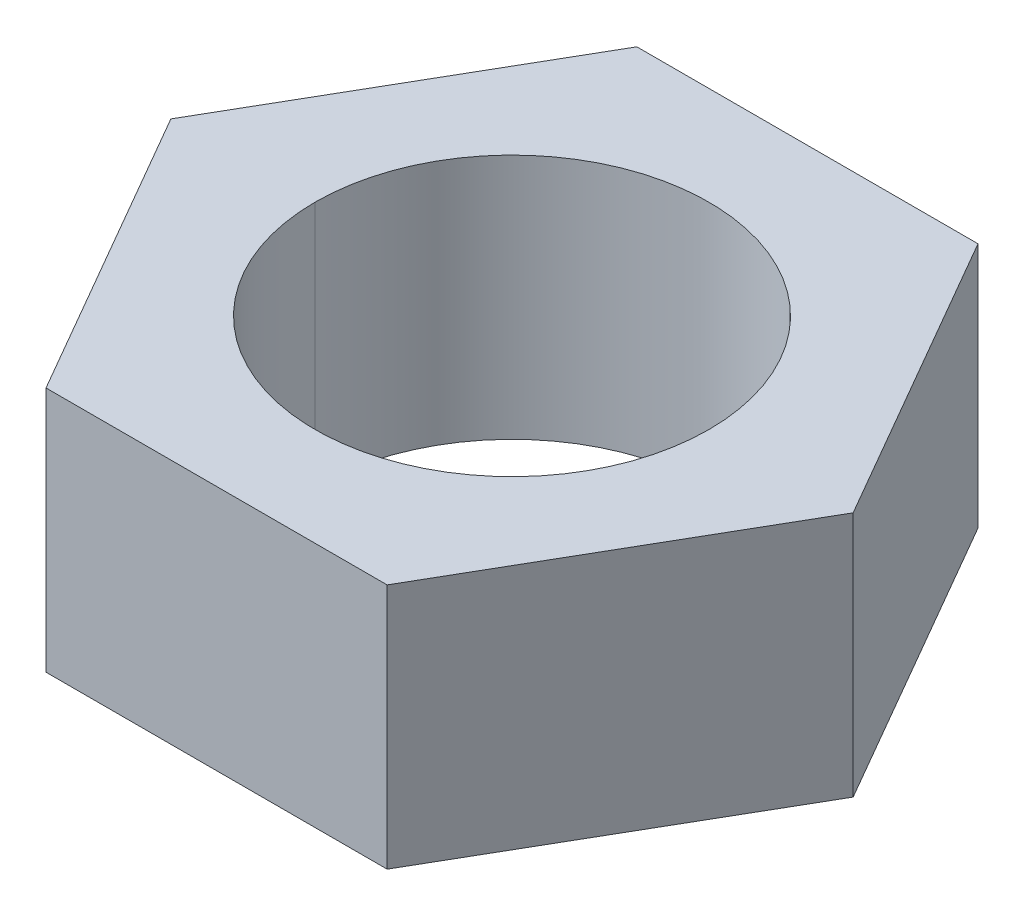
ISO-10303-21;
HEADER;
FILE_DESCRIPTION(('STEP AP214'),'2;1');
FILE_NAME('part.step','',(''),(''),'','','');
FILE_SCHEMA(('AUTOMOTIVE_DESIGN { 1 0 10303 214 1 1 1 1 }'));
ENDSEC;
DATA;
#1=APPLICATION_CONTEXT('core data for automotive mechanical design processes');
#2=APPLICATION_PROTOCOL_DEFINITION('international standard','automotive_design',2000,#1);
#3=PRODUCT_CONTEXT('',#1,'mechanical');
#4=PRODUCT('Part','Part','',(#3));
#5=PRODUCT_RELATED_PRODUCT_CATEGORY('part','',(#4));
#6=PRODUCT_DEFINITION_FORMATION('','',#4);
#7=PRODUCT_DEFINITION_CONTEXT('part definition',#1,'design');
#8=PRODUCT_DEFINITION('design','',#6,#7);
#9=PRODUCT_DEFINITION_SHAPE('','',#8);
#10=(LENGTH_UNIT() NAMED_UNIT(*) SI_UNIT(.MILLI.,.METRE.));
#11=(NAMED_UNIT(*) PLANE_ANGLE_UNIT() SI_UNIT($,.RADIAN.));
#12=(NAMED_UNIT(*) SI_UNIT($,.STERADIAN.) SOLID_ANGLE_UNIT());
#13=UNCERTAINTY_MEASURE_WITH_UNIT(LENGTH_MEASURE(1.E-05),#10,'distance_accuracy_value','');
#14=(GEOMETRIC_REPRESENTATION_CONTEXT(3) GLOBAL_UNCERTAINTY_ASSIGNED_CONTEXT((#13)) GLOBAL_UNIT_ASSIGNED_CONTEXT((#10,
#11,#12)) REPRESENTATION_CONTEXT('',''));
#15=CARTESIAN_POINT('',(0.,0.,0.));
#16=DIRECTION('',(0.,0.,1.));
#17=DIRECTION('',(1.,0.,0.));
#18=AXIS2_PLACEMENT_3D('',#15,#16,#17);
#19=CARTESIAN_POINT('',(-5.49926131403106,3.96875000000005,9.525));
#20=DIRECTION('',(0.,-1.,0.));
#21=DIRECTION('',(0.,0.,-1.));
#22=AXIS2_PLACEMENT_3D('',#19,#20,#21);
#23=PLANE('',#22);
#24=DIRECTION('',(0.500000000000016,0.,-0.866025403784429));
#25=VECTOR('',#24,1.);
#26=CARTESIAN_POINT('',(5.49926131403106,3.96875000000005,9.525));
#27=LINE('',#26,#25);
#28=CARTESIAN_POINT('',(10.9985226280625,3.96875000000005,0.));
#29=VERTEX_POINT('',#28);
#30=CARTESIAN_POINT('',(5.49926131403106,3.96875000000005,9.525));
#31=VERTEX_POINT('',#30);
#32=EDGE_CURVE('E122',#29,#31,#27,.F.);
#33=ORIENTED_EDGE('',*,*,#32,.F.);
#34=DIRECTION('',(-0.500000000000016,0.,-0.866025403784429));
#35=VECTOR('',#34,1.);
#36=CARTESIAN_POINT('',(10.9985226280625,3.96875000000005,0.));
#37=LINE('',#36,#35);
#38=CARTESIAN_POINT('',(5.49926131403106,3.96875000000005,-9.525));
#39=VERTEX_POINT('',#38);
#40=EDGE_CURVE('E116',#39,#29,#37,.F.);
#41=ORIENTED_EDGE('',*,*,#40,.F.);
#42=DIRECTION('',(-1.,0.,0.));
#43=VECTOR('',#42,1.);
#44=CARTESIAN_POINT('',(5.49926131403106,3.96875000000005,-9.525));
#45=LINE('',#44,#43);
#46=CARTESIAN_POINT('',(-5.49926131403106,3.96875000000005,-9.525));
#47=VERTEX_POINT('',#46);
#48=EDGE_CURVE('E110',#47,#39,#45,.F.);
#49=ORIENTED_EDGE('',*,*,#48,.F.);
#50=DIRECTION('',(-0.500000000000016,0.,0.866025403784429));
#51=VECTOR('',#50,1.);
#52=CARTESIAN_POINT('',(-5.49926131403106,3.96875000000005,-9.525));
#53=LINE('',#52,#51);
#54=CARTESIAN_POINT('',(-10.9985226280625,3.96875000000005,0.));
#55=VERTEX_POINT('',#54);
#56=EDGE_CURVE('E104',#55,#47,#53,.F.);
#57=ORIENTED_EDGE('',*,*,#56,.F.);
#58=DIRECTION('',(0.500000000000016,0.,0.866025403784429));
#59=VECTOR('',#58,1.);
#60=CARTESIAN_POINT('',(-10.9985226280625,3.96875000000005,0.));
#61=LINE('',#60,#59);
#62=CARTESIAN_POINT('',(-5.49926131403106,3.96875000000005,9.525));
#63=VERTEX_POINT('',#62);
#64=EDGE_CURVE('E95',#63,#55,#61,.F.);
#65=ORIENTED_EDGE('',*,*,#64,.F.);
#66=DIRECTION('',(1.,0.,0.));
#67=VECTOR('',#66,1.);
#68=CARTESIAN_POINT('',(-5.49926131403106,3.96875000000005,9.525));
#69=LINE('',#68,#67);
#70=EDGE_CURVE('E127',#31,#63,#69,.F.);
#71=ORIENTED_EDGE('',*,*,#70,.F.);
#72=EDGE_LOOP('',(#33,#41,#49,#57,#65,#71));
#73=FACE_BOUND('',#72,.T.);
#74=CARTESIAN_POINT('',(0.,3.96875000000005,0.));
#75=DIRECTION('',(0.,-1.,0.));
#76=DIRECTION('',(0.,0.,-1.));
#77=AXIS2_PLACEMENT_3D('',#74,#75,#76);
#78=CIRCLE('',#77,6.35);
#79=CARTESIAN_POINT('',(6.35,3.96875000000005,0.));
#80=VERTEX_POINT('',#79);
#81=CARTESIAN_POINT('',(-6.35,3.96875000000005,0.));
#82=VERTEX_POINT('',#81);
#83=EDGE_CURVE('E19',#80,#82,#78,.T.);
#84=ORIENTED_EDGE('',*,*,#83,.T.);
#85=CARTESIAN_POINT('',(0.,3.96875000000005,0.));
#86=DIRECTION('',(0.,-1.,0.));
#87=DIRECTION('',(0.,0.,-1.));
#88=AXIS2_PLACEMENT_3D('',#85,#86,#87);
#89=CIRCLE('',#88,6.35);
#90=EDGE_CURVE('E79',#82,#80,#89,.T.);
#91=ORIENTED_EDGE('',*,*,#90,.T.);
#92=EDGE_LOOP('',(#84,#91));
#93=FACE_BOUND('',#92,.T.);
#94=ADVANCED_FACE('F16',(#73,#93),#23,.F.);
#95=CARTESIAN_POINT('',(0.,3.96875000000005,0.));
#96=DIRECTION('',(0.,-1.,0.));
#97=DIRECTION('',(0.,0.,-1.));
#98=AXIS2_PLACEMENT_3D('',#95,#96,#97);
#99=CYLINDRICAL_SURFACE('',#98,6.35);
#100=CARTESIAN_POINT('',(0.,-3.96875000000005,0.));
#101=DIRECTION('',(0.,-1.,0.));
#102=DIRECTION('',(0.,0.,-1.));
#103=AXIS2_PLACEMENT_3D('',#100,#101,#102);
#104=CIRCLE('',#103,6.35);
#105=CARTESIAN_POINT('',(-6.35,-3.96875000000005,0.));
#106=VERTEX_POINT('',#105);
#107=CARTESIAN_POINT('',(6.35,-3.96875000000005,0.));
#108=VERTEX_POINT('',#107);
#109=EDGE_CURVE('E88',#106,#108,#104,.F.);
#110=ORIENTED_EDGE('',*,*,#109,.F.);
#111=DIRECTION('',(0.,-1.,0.));
#112=VECTOR('',#111,1.);
#113=CARTESIAN_POINT('',(-6.35,3.96875000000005,0.));
#114=LINE('',#113,#112);
#115=EDGE_CURVE('E84',#106,#82,#114,.F.);
#116=ORIENTED_EDGE('',*,*,#115,.T.);
#117=ORIENTED_EDGE('',*,*,#83,.F.);
#118=DIRECTION('',(0.,-1.,0.));
#119=VECTOR('',#118,1.);
#120=CARTESIAN_POINT('',(6.35,3.96875000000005,0.));
#121=LINE('',#120,#119);
#122=EDGE_CURVE('E94',#80,#108,#121,.T.);
#123=ORIENTED_EDGE('',*,*,#122,.T.);
#124=EDGE_LOOP('',(#110,#116,#117,#123));
#125=FACE_BOUND('',#124,.T.);
#126=ADVANCED_FACE('F86',(#125),#99,.F.);
#127=CARTESIAN_POINT('',(0.,3.96875000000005,0.));
#128=DIRECTION('',(0.,-1.,0.));
#129=DIRECTION('',(0.,0.,-1.));
#130=AXIS2_PLACEMENT_3D('',#127,#128,#129);
#131=CYLINDRICAL_SURFACE('',#130,6.35);
#132=ORIENTED_EDGE('',*,*,#90,.F.);
#133=ORIENTED_EDGE('',*,*,#115,.F.);
#134=CARTESIAN_POINT('',(0.,-3.96875000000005,0.));
#135=DIRECTION('',(0.,-1.,0.));
#136=DIRECTION('',(0.,0.,-1.));
#137=AXIS2_PLACEMENT_3D('',#134,#135,#136);
#138=CIRCLE('',#137,6.35);
#139=EDGE_CURVE('E99',#108,#106,#138,.F.);
#140=ORIENTED_EDGE('',*,*,#139,.F.);
#141=ORIENTED_EDGE('',*,*,#122,.F.);
#142=EDGE_LOOP('',(#132,#133,#140,#141));
#143=FACE_BOUND('',#142,.T.);
#144=ADVANCED_FACE('F93',(#143),#131,.F.);
#145=CARTESIAN_POINT('',(-10.9985226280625,-3.96874999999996,0.));
#146=DIRECTION('',(-0.866025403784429,0.,0.500000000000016));
#147=DIRECTION('',(0.500000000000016,0.,0.866025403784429));
#148=AXIS2_PLACEMENT_3D('',#145,#146,#147);
#149=PLANE('',#148);
#150=DIRECTION('',(-0.500000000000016,0.,-0.866025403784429));
#151=VECTOR('',#150,1.);
#152=CARTESIAN_POINT('',(-5.49926131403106,-3.96875000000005,9.525));
#153=LINE('',#152,#151);
#154=CARTESIAN_POINT('',(-5.49926131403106,-3.96874999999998,9.525));
#155=VERTEX_POINT('',#154);
#156=CARTESIAN_POINT('',(-10.9985226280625,-3.96874999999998,0.));
#157=VERTEX_POINT('',#156);
#158=EDGE_CURVE('E100',#155,#157,#153,.T.);
#159=ORIENTED_EDGE('',*,*,#158,.F.);
#160=DIRECTION('',(0.,1.,0.));
#161=VECTOR('',#160,1.);
#162=CARTESIAN_POINT('',(-5.49926131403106,-3.96874999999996,9.525));
#163=LINE('',#162,#161);
#164=EDGE_CURVE('E130',#63,#155,#163,.F.);
#165=ORIENTED_EDGE('',*,*,#164,.F.);
#166=ORIENTED_EDGE('',*,*,#64,.T.);
#167=DIRECTION('',(0.,1.,0.));
#168=VECTOR('',#167,1.);
#169=CARTESIAN_POINT('',(-10.9985226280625,-3.96874999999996,0.));
#170=LINE('',#169,#168);
#171=EDGE_CURVE('E107',#157,#55,#170,.T.);
#172=ORIENTED_EDGE('',*,*,#171,.F.);
#173=EDGE_LOOP('',(#159,#165,#166,#172));
#174=FACE_BOUND('',#173,.T.);
#175=ADVANCED_FACE('F162',(#174),#149,.T.);
#176=CARTESIAN_POINT('',(-5.49926131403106,-3.96874999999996,-9.525));
#177=DIRECTION('',(-0.866025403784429,0.,-0.500000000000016));
#178=DIRECTION('',(-0.500000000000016,0.,0.866025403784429));
#179=AXIS2_PLACEMENT_3D('',#176,#177,#178);
#180=PLANE('',#179);
#181=DIRECTION('',(0.500000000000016,0.,-0.866025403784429));
#182=VECTOR('',#181,1.);
#183=CARTESIAN_POINT('',(-10.9985226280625,-3.96875000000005,0.));
#184=LINE('',#183,#182);
#185=CARTESIAN_POINT('',(-5.49926131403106,-3.96874999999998,-9.525));
#186=VERTEX_POINT('',#185);
#187=EDGE_CURVE('E136',#157,#186,#184,.T.);
#188=ORIENTED_EDGE('',*,*,#187,.F.);
#189=ORIENTED_EDGE('',*,*,#171,.T.);
#190=ORIENTED_EDGE('',*,*,#56,.T.);
#191=DIRECTION('',(0.,1.,0.));
#192=VECTOR('',#191,1.);
#193=CARTESIAN_POINT('',(-5.49926131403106,-3.96874999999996,-9.525));
#194=LINE('',#193,#192);
#195=EDGE_CURVE('E113',#186,#47,#194,.T.);
#196=ORIENTED_EDGE('',*,*,#195,.F.);
#197=EDGE_LOOP('',(#188,#189,#190,#196));
#198=FACE_BOUND('',#197,.T.);
#199=ADVANCED_FACE('F159',(#198),#180,.T.);
#200=CARTESIAN_POINT('',(5.49926131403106,-3.96874999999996,-9.525));
#201=DIRECTION('',(0.,0.,-1.));
#202=DIRECTION('',(-1.,0.,0.));
#203=AXIS2_PLACEMENT_3D('',#200,#201,#202);
#204=PLANE('',#203);
#205=DIRECTION('',(1.,0.,0.));
#206=VECTOR('',#205,1.);
#207=CARTESIAN_POINT('',(0.,-3.96875000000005,-9.525));
#208=LINE('',#207,#206);
#209=CARTESIAN_POINT('',(5.49926131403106,-3.96874999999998,-9.525));
#210=VERTEX_POINT('',#209);
#211=EDGE_CURVE('E139',#186,#210,#208,.T.);
#212=ORIENTED_EDGE('',*,*,#211,.F.);
#213=ORIENTED_EDGE('',*,*,#195,.T.);
#214=ORIENTED_EDGE('',*,*,#48,.T.);
#215=DIRECTION('',(0.,1.,0.));
#216=VECTOR('',#215,1.);
#217=CARTESIAN_POINT('',(5.49926131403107,-3.96874999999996,-9.525));
#218=LINE('',#217,#216);
#219=EDGE_CURVE('E119',#210,#39,#218,.T.);
#220=ORIENTED_EDGE('',*,*,#219,.F.);
#221=EDGE_LOOP('',(#212,#213,#214,#220));
#222=FACE_BOUND('',#221,.T.);
#223=ADVANCED_FACE('F156',(#222),#204,.T.);
#224=CARTESIAN_POINT('',(10.9985226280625,-3.96874999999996,0.));
#225=DIRECTION('',(0.866025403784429,0.,-0.500000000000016));
#226=DIRECTION('',(-0.500000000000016,0.,-0.866025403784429));
#227=AXIS2_PLACEMENT_3D('',#224,#225,#226);
#228=PLANE('',#227);
#229=DIRECTION('',(0.500000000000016,0.,0.866025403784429));
#230=VECTOR('',#229,1.);
#231=CARTESIAN_POINT('',(5.49926131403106,-3.96875000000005,-9.525));
#232=LINE('',#231,#230);
#233=CARTESIAN_POINT('',(10.9985226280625,-3.96874999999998,0.));
#234=VERTEX_POINT('',#233);
#235=EDGE_CURVE('E142',#210,#234,#232,.T.);
#236=ORIENTED_EDGE('',*,*,#235,.F.);
#237=ORIENTED_EDGE('',*,*,#219,.T.);
#238=ORIENTED_EDGE('',*,*,#40,.T.);
#239=DIRECTION('',(0.,1.,0.));
#240=VECTOR('',#239,1.);
#241=CARTESIAN_POINT('',(10.9985226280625,-3.96874999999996,0.));
#242=LINE('',#241,#240);
#243=EDGE_CURVE('E124',#234,#29,#242,.T.);
#244=ORIENTED_EDGE('',*,*,#243,.F.);
#245=EDGE_LOOP('',(#236,#237,#238,#244));
#246=FACE_BOUND('',#245,.T.);
#247=ADVANCED_FACE('F152',(#246),#228,.T.);
#248=CARTESIAN_POINT('',(5.49926131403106,-3.96874999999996,9.525));
#249=DIRECTION('',(0.866025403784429,0.,0.500000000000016));
#250=DIRECTION('',(0.500000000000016,0.,-0.866025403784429));
#251=AXIS2_PLACEMENT_3D('',#248,#249,#250);
#252=PLANE('',#251);
#253=DIRECTION('',(-0.500000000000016,0.,0.866025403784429));
#254=VECTOR('',#253,1.);
#255=CARTESIAN_POINT('',(10.9985226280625,-3.96875000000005,0.));
#256=LINE('',#255,#254);
#257=CARTESIAN_POINT('',(5.49926131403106,-3.96874999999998,9.525));
#258=VERTEX_POINT('',#257);
#259=EDGE_CURVE('E25',#234,#258,#256,.T.);
#260=ORIENTED_EDGE('',*,*,#259,.F.);
#261=ORIENTED_EDGE('',*,*,#243,.T.);
#262=ORIENTED_EDGE('',*,*,#32,.T.);
#263=DIRECTION('',(0.,1.,0.));
#264=VECTOR('',#263,1.);
#265=CARTESIAN_POINT('',(5.49926131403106,-3.96874999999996,9.525));
#266=LINE('',#265,#264);
#267=EDGE_CURVE('E34',#258,#31,#266,.T.);
#268=ORIENTED_EDGE('',*,*,#267,.F.);
#269=EDGE_LOOP('',(#260,#261,#262,#268));
#270=FACE_BOUND('',#269,.T.);
#271=ADVANCED_FACE('F150',(#270),#252,.T.);
#272=CARTESIAN_POINT('',(-5.49926131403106,-3.96874999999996,9.525));
#273=DIRECTION('',(0.,0.,1.));
#274=DIRECTION('',(1.,0.,0.));
#275=AXIS2_PLACEMENT_3D('',#272,#273,#274);
#276=PLANE('',#275);
#277=DIRECTION('',(1.,0.,0.));
#278=VECTOR('',#277,1.);
#279=CARTESIAN_POINT('',(0.,-3.96875000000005,9.525));
#280=LINE('',#279,#278);
#281=EDGE_CURVE('E11',#258,#155,#280,.F.);
#282=ORIENTED_EDGE('',*,*,#281,.F.);
#283=ORIENTED_EDGE('',*,*,#267,.T.);
#284=ORIENTED_EDGE('',*,*,#70,.T.);
#285=ORIENTED_EDGE('',*,*,#164,.T.);
#286=EDGE_LOOP('',(#282,#283,#284,#285));
#287=FACE_BOUND('',#286,.T.);
#288=ADVANCED_FACE('F164',(#287),#276,.T.);
#289=CARTESIAN_POINT('',(0.,-3.96875000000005,0.));
#290=DIRECTION('',(0.,-1.,0.));
#291=DIRECTION('',(0.,0.,-1.));
#292=AXIS2_PLACEMENT_3D('',#289,#290,#291);
#293=PLANE('',#292);
#294=ORIENTED_EDGE('',*,*,#259,.T.);
#295=ORIENTED_EDGE('',*,*,#281,.T.);
#296=ORIENTED_EDGE('',*,*,#158,.T.);
#297=ORIENTED_EDGE('',*,*,#187,.T.);
#298=ORIENTED_EDGE('',*,*,#211,.T.);
#299=ORIENTED_EDGE('',*,*,#235,.T.);
#300=EDGE_LOOP('',(#294,#295,#296,#297,#298,#299));
#301=FACE_BOUND('',#300,.T.);
#302=ORIENTED_EDGE('',*,*,#109,.T.);
#303=ORIENTED_EDGE('',*,*,#139,.T.);
#304=EDGE_LOOP('',(#302,#303));
#305=FACE_BOUND('',#304,.T.);
#306=ADVANCED_FACE('F147',(#301,#305),#293,.T.);
#307=CLOSED_SHELL('',(#94,#126,#144,#175,#199,#223,#247,#271,#288,#306));
#308=MANIFOLD_SOLID_BREP('B1',#307);
#309=ADVANCED_BREP_SHAPE_REPRESENTATION('',(#18,#308),#14);
#310=SHAPE_DEFINITION_REPRESENTATION(#9,#309);
ENDSEC;
END-ISO-10303-21;
